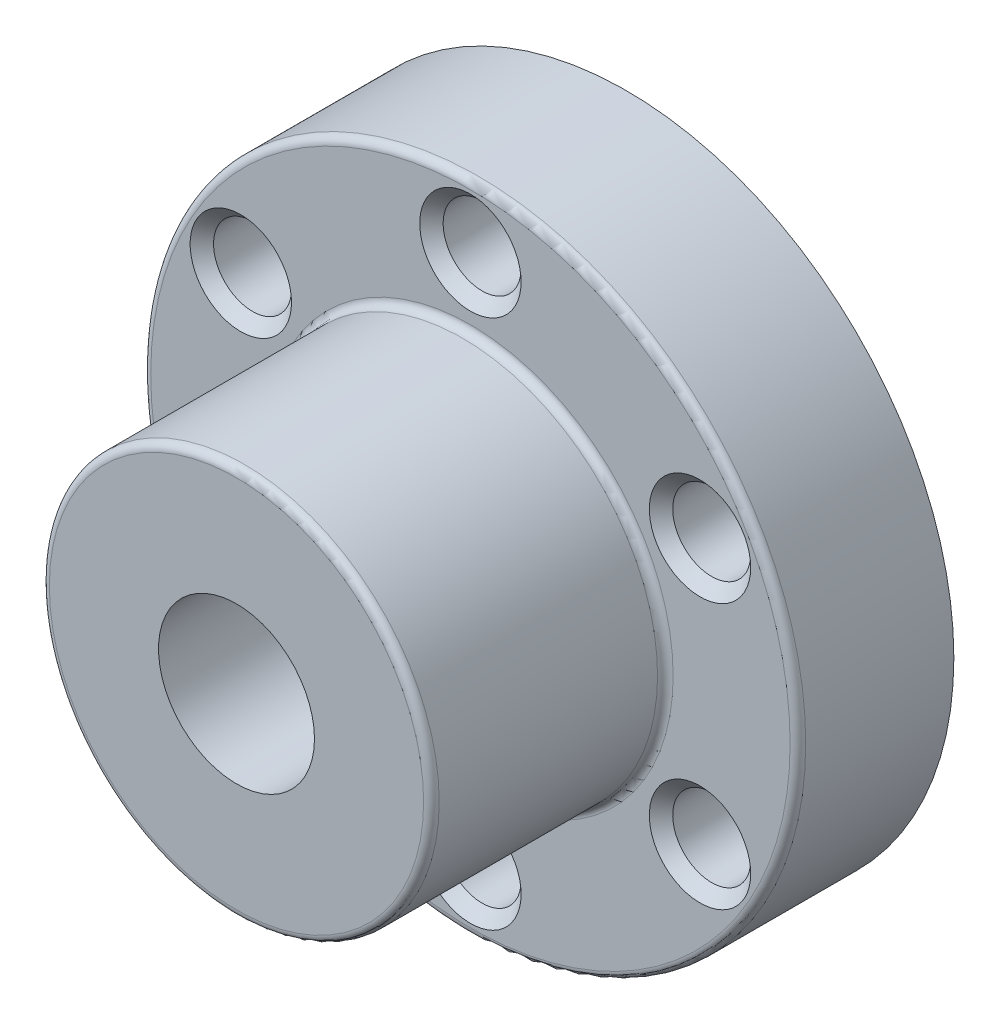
ISO-10303-21;
HEADER;
FILE_DESCRIPTION(('STEP AP214'),'2;1');
FILE_NAME('part.step','',(''),(''),'','','');
FILE_SCHEMA(('AUTOMOTIVE_DESIGN { 1 0 10303 214 1 1 1 1 }'));
ENDSEC;
DATA;
#1=APPLICATION_CONTEXT('core data for automotive mechanical design processes');
#2=APPLICATION_PROTOCOL_DEFINITION('international standard','automotive_design',2000,#1);
#3=PRODUCT_CONTEXT('',#1,'mechanical');
#4=PRODUCT('Part','Part','',(#3));
#5=PRODUCT_RELATED_PRODUCT_CATEGORY('part','',(#4));
#6=PRODUCT_DEFINITION_FORMATION('','',#4);
#7=PRODUCT_DEFINITION_CONTEXT('part definition',#1,'design');
#8=PRODUCT_DEFINITION('design','',#6,#7);
#9=PRODUCT_DEFINITION_SHAPE('','',#8);
#10=(LENGTH_UNIT() NAMED_UNIT(*) SI_UNIT(.MILLI.,.METRE.));
#11=(NAMED_UNIT(*) PLANE_ANGLE_UNIT() SI_UNIT($,.RADIAN.));
#12=(NAMED_UNIT(*) SI_UNIT($,.STERADIAN.) SOLID_ANGLE_UNIT());
#13=UNCERTAINTY_MEASURE_WITH_UNIT(LENGTH_MEASURE(1.E-05),#10,'distance_accuracy_value','');
#14=(GEOMETRIC_REPRESENTATION_CONTEXT(3) GLOBAL_UNCERTAINTY_ASSIGNED_CONTEXT((#13)) GLOBAL_UNIT_ASSIGNED_CONTEXT((#10,
#11,#12)) REPRESENTATION_CONTEXT('',''));
#15=CARTESIAN_POINT('',(0.,0.,0.));
#16=DIRECTION('',(0.,0.,1.));
#17=DIRECTION('',(1.,0.,0.));
#18=AXIS2_PLACEMENT_3D('',#15,#16,#17);
#19=CARTESIAN_POINT('',(0.,0.,10.));
#20=DIRECTION('',(0.,0.,1.));
#21=DIRECTION('',(1.,0.,0.));
#22=AXIS2_PLACEMENT_3D('',#19,#20,#21);
#23=PLANE('',#22);
#24=CARTESIAN_POINT('',(-14.7224318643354,8.50000000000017,10.));
#25=DIRECTION('',(0.,0.,1.));
#26=DIRECTION('',(1.,0.,0.));
#27=AXIS2_PLACEMENT_3D('',#24,#25,#26);
#28=CIRCLE('',#27,3.25);
#29=CARTESIAN_POINT('',(-11.4724318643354,8.50000000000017,10.));
#30=VERTEX_POINT('',#29);
#31=EDGE_CURVE('E10',#30,#30,#28,.F.);
#32=ORIENTED_EDGE('',*,*,#31,.T.);
#33=EDGE_LOOP('',(#32));
#34=FACE_BOUND('',#33,.T.);
#35=CARTESIAN_POINT('',(-14.7224318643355,-8.49999999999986,10.));
#36=DIRECTION('',(0.,0.,1.));
#37=DIRECTION('',(1.,0.,0.));
#38=AXIS2_PLACEMENT_3D('',#35,#36,#37);
#39=CIRCLE('',#38,3.25);
#40=CARTESIAN_POINT('',(-11.4724318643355,-8.49999999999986,10.));
#41=VERTEX_POINT('',#40);
#42=EDGE_CURVE('E42',#41,#41,#39,.F.);
#43=ORIENTED_EDGE('',*,*,#42,.T.);
#44=EDGE_LOOP('',(#43));
#45=FACE_BOUND('',#44,.T.);
#46=CARTESIAN_POINT('',(0.,-17.,10.));
#47=DIRECTION('',(0.,0.,1.));
#48=DIRECTION('',(1.,0.,0.));
#49=AXIS2_PLACEMENT_3D('',#46,#47,#48);
#50=CIRCLE('',#49,3.25);
#51=CARTESIAN_POINT('',(3.25,-17.,10.));
#52=VERTEX_POINT('',#51);
#53=EDGE_CURVE('E51',#52,#52,#50,.F.);
#54=ORIENTED_EDGE('',*,*,#53,.T.);
#55=EDGE_LOOP('',(#54));
#56=FACE_BOUND('',#55,.T.);
#57=CARTESIAN_POINT('',(14.7224318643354,-8.50000000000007,10.));
#58=DIRECTION('',(0.,0.,1.));
#59=DIRECTION('',(1.,0.,0.));
#60=AXIS2_PLACEMENT_3D('',#57,#58,#59);
#61=CIRCLE('',#60,3.25);
#62=CARTESIAN_POINT('',(17.9724318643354,-8.50000000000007,10.));
#63=VERTEX_POINT('',#62);
#64=EDGE_CURVE('E57',#63,#63,#61,.F.);
#65=ORIENTED_EDGE('',*,*,#64,.T.);
#66=EDGE_LOOP('',(#65));
#67=FACE_BOUND('',#66,.T.);
#68=CARTESIAN_POINT('',(14.7224318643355,8.49999999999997,10.));
#69=DIRECTION('',(0.,0.,1.));
#70=DIRECTION('',(1.,0.,0.));
#71=AXIS2_PLACEMENT_3D('',#68,#69,#70);
#72=CIRCLE('',#71,3.25);
#73=CARTESIAN_POINT('',(17.9724318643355,8.49999999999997,10.));
#74=VERTEX_POINT('',#73);
#75=EDGE_CURVE('E63',#74,#74,#72,.F.);
#76=ORIENTED_EDGE('',*,*,#75,.T.);
#77=EDGE_LOOP('',(#76));
#78=FACE_BOUND('',#77,.T.);
#79=CARTESIAN_POINT('',(0.,17.,10.));
#80=DIRECTION('',(0.,0.,1.));
#81=DIRECTION('',(1.,0.,0.));
#82=AXIS2_PLACEMENT_3D('',#79,#80,#81);
#83=CIRCLE('',#82,3.25);
#84=CARTESIAN_POINT('',(3.25,17.,10.));
#85=VERTEX_POINT('',#84);
#86=EDGE_CURVE('E69',#85,#85,#83,.F.);
#87=ORIENTED_EDGE('',*,*,#86,.T.);
#88=EDGE_LOOP('',(#87));
#89=FACE_BOUND('',#88,.T.);
#90=CARTESIAN_POINT('',(0.,0.,10.));
#91=DIRECTION('',(0.,0.,1.));
#92=DIRECTION('',(1.,0.,0.));
#93=AXIS2_PLACEMENT_3D('',#90,#91,#92);
#94=CIRCLE('',#93,20.5);
#95=CARTESIAN_POINT('',(20.5,0.,10.));
#96=VERTEX_POINT('',#95);
#97=EDGE_CURVE('E87',#96,#96,#94,.T.);
#98=ORIENTED_EDGE('',*,*,#97,.T.);
#99=EDGE_LOOP('',(#98));
#100=FACE_BOUND('',#99,.T.);
#101=CARTESIAN_POINT('',(0.,0.,10.));
#102=DIRECTION('',(0.,0.,1.));
#103=DIRECTION('',(1.,0.,0.));
#104=AXIS2_PLACEMENT_3D('',#101,#102,#103);
#105=CIRCLE('',#104,13.);
#106=CARTESIAN_POINT('',(13.,0.,10.));
#107=VERTEX_POINT('',#106);
#108=EDGE_CURVE('E90',#107,#107,#105,.F.);
#109=ORIENTED_EDGE('',*,*,#108,.T.);
#110=EDGE_LOOP('',(#109));
#111=FACE_BOUND('',#110,.T.);
#112=ADVANCED_FACE('F31',(#34,#45,#56,#67,#78,#89,#100,#111),#23,.T.);
#113=CARTESIAN_POINT('',(0.,0.,10.));
#114=DIRECTION('',(0.,0.,-1.));
#115=DIRECTION('',(-1.,0.,0.));
#116=AXIS2_PLACEMENT_3D('',#113,#114,#115);
#117=CYLINDRICAL_SURFACE('',#116,21.);
#118=CARTESIAN_POINT('',(0.,0.,9.5));
#119=DIRECTION('',(0.,0.,1.));
#120=DIRECTION('',(1.,0.,0.));
#121=AXIS2_PLACEMENT_3D('',#118,#119,#120);
#122=CIRCLE('',#121,21.);
#123=CARTESIAN_POINT('',(21.,0.,9.5));
#124=VERTEX_POINT('',#123);
#125=EDGE_CURVE('E84',#124,#124,#122,.F.);
#126=ORIENTED_EDGE('',*,*,#125,.T.);
#127=EDGE_LOOP('',(#126));
#128=FACE_BOUND('',#127,.T.);
#129=CARTESIAN_POINT('',(0.,0.,0.));
#130=DIRECTION('',(0.,0.,1.));
#131=DIRECTION('',(1.,0.,0.));
#132=AXIS2_PLACEMENT_3D('',#129,#130,#131);
#133=CIRCLE('',#132,21.);
#134=CARTESIAN_POINT('',(21.,0.,0.));
#135=VERTEX_POINT('',#134);
#136=EDGE_CURVE('E93',#135,#135,#133,.T.);
#137=ORIENTED_EDGE('',*,*,#136,.T.);
#138=EDGE_LOOP('',(#137));
#139=FACE_BOUND('',#138,.T.);
#140=ADVANCED_FACE('F127',(#128,#139),#117,.T.);
#141=CARTESIAN_POINT('',(0.,0.,0.));
#142=DIRECTION('',(0.,0.,1.));
#143=DIRECTION('',(1.,0.,0.));
#144=AXIS2_PLACEMENT_3D('',#141,#142,#143);
#145=PLANE('',#144);
#146=CARTESIAN_POINT('',(-14.7224318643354,8.50000000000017,0.));
#147=DIRECTION('',(0.,0.,-1.));
#148=DIRECTION('',(-0.50000000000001,-0.866025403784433,0.));
#149=AXIS2_PLACEMENT_3D('',#146,#147,#148);
#150=CIRCLE('',#149,2.5);
#151=CARTESIAN_POINT('',(-15.9724318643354,6.33493649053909,0.));
#152=VERTEX_POINT('',#151);
#153=EDGE_CURVE('E117',#152,#152,#150,.T.);
#154=ORIENTED_EDGE('',*,*,#153,.F.);
#155=EDGE_LOOP('',(#154));
#156=FACE_BOUND('',#155,.T.);
#157=CARTESIAN_POINT('',(-14.7224318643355,-8.49999999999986,0.));
#158=DIRECTION('',(0.,0.,-1.));
#159=DIRECTION('',(0.499999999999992,-0.866025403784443,0.));
#160=AXIS2_PLACEMENT_3D('',#157,#158,#159);
#161=CIRCLE('',#160,2.5);
#162=CARTESIAN_POINT('',(-13.4724318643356,-10.665063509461,0.));
#163=VERTEX_POINT('',#162);
#164=EDGE_CURVE('E114',#163,#163,#161,.T.);
#165=ORIENTED_EDGE('',*,*,#164,.F.);
#166=EDGE_LOOP('',(#165));
#167=FACE_BOUND('',#166,.T.);
#168=CARTESIAN_POINT('',(0.,-17.,0.));
#169=DIRECTION('',(0.,0.,-1.));
#170=DIRECTION('',(1.,0.,0.));
#171=AXIS2_PLACEMENT_3D('',#168,#169,#170);
#172=CIRCLE('',#171,2.5);
#173=CARTESIAN_POINT('',(2.5,-17.,0.));
#174=VERTEX_POINT('',#173);
#175=EDGE_CURVE('E111',#174,#174,#172,.T.);
#176=ORIENTED_EDGE('',*,*,#175,.F.);
#177=EDGE_LOOP('',(#176));
#178=FACE_BOUND('',#177,.T.);
#179=CARTESIAN_POINT('',(14.7224318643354,-8.50000000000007,0.));
#180=DIRECTION('',(0.,0.,-1.));
#181=DIRECTION('',(0.500000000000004,0.866025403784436,0.));
#182=AXIS2_PLACEMENT_3D('',#179,#180,#181);
#183=CIRCLE('',#182,2.5);
#184=CARTESIAN_POINT('',(15.9724318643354,-6.33493649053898,0.));
#185=VERTEX_POINT('',#184);
#186=EDGE_CURVE('E108',#185,#185,#183,.T.);
#187=ORIENTED_EDGE('',*,*,#186,.F.);
#188=EDGE_LOOP('',(#187));
#189=FACE_BOUND('',#188,.T.);
#190=CARTESIAN_POINT('',(14.7224318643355,8.49999999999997,0.));
#191=DIRECTION('',(0.,0.,-1.));
#192=DIRECTION('',(-0.499999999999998,0.86602540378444,0.));
#193=AXIS2_PLACEMENT_3D('',#190,#191,#192);
#194=CIRCLE('',#193,2.5);
#195=CARTESIAN_POINT('',(13.4724318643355,10.6650635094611,0.));
#196=VERTEX_POINT('',#195);
#197=EDGE_CURVE('E105',#196,#196,#194,.T.);
#198=ORIENTED_EDGE('',*,*,#197,.F.);
#199=EDGE_LOOP('',(#198));
#200=FACE_BOUND('',#199,.T.);
#201=CARTESIAN_POINT('',(0.,17.,0.));
#202=DIRECTION('',(0.,0.,-1.));
#203=DIRECTION('',(-1.,0.,0.));
#204=AXIS2_PLACEMENT_3D('',#201,#202,#203);
#205=CIRCLE('',#204,2.5);
#206=CARTESIAN_POINT('',(-2.5,17.,0.));
#207=VERTEX_POINT('',#206);
#208=EDGE_CURVE('E100',#207,#207,#205,.T.);
#209=ORIENTED_EDGE('',*,*,#208,.F.);
#210=EDGE_LOOP('',(#209));
#211=FACE_BOUND('',#210,.T.);
#212=CARTESIAN_POINT('',(0.,0.,0.));
#213=DIRECTION('',(0.,0.,1.));
#214=DIRECTION('',(1.,0.,0.));
#215=AXIS2_PLACEMENT_3D('',#212,#213,#214);
#216=CIRCLE('',#215,5.);
#217=CARTESIAN_POINT('',(5.,0.,0.));
#218=VERTEX_POINT('',#217);
#219=EDGE_CURVE('E96',#218,#218,#216,.T.);
#220=ORIENTED_EDGE('',*,*,#219,.T.);
#221=EDGE_LOOP('',(#220));
#222=FACE_BOUND('',#221,.T.);
#223=ORIENTED_EDGE('',*,*,#136,.F.);
#224=EDGE_LOOP('',(#223));
#225=FACE_BOUND('',#224,.T.);
#226=ADVANCED_FACE('F123',(#156,#167,#178,#189,#200,#211,#222,#225),#145,.F.);
#227=CARTESIAN_POINT('',(0.,0.,25.));
#228=DIRECTION('',(0.,0.,-1.));
#229=DIRECTION('',(-1.,0.,0.));
#230=AXIS2_PLACEMENT_3D('',#227,#228,#229);
#231=CYLINDRICAL_SURFACE('',#230,12.5);
#232=CARTESIAN_POINT('',(0.,0.,10.5));
#233=DIRECTION('',(0.,0.,1.));
#234=DIRECTION('',(1.,0.,0.));
#235=AXIS2_PLACEMENT_3D('',#232,#233,#234);
#236=CIRCLE('',#235,12.5);
#237=CARTESIAN_POINT('',(12.5,0.,10.5));
#238=VERTEX_POINT('',#237);
#239=EDGE_CURVE('E78',#238,#238,#236,.T.);
#240=ORIENTED_EDGE('',*,*,#239,.T.);
#241=EDGE_LOOP('',(#240));
#242=FACE_BOUND('',#241,.T.);
#243=CARTESIAN_POINT('',(0.,0.,24.5));
#244=DIRECTION('',(0.,0.,1.));
#245=DIRECTION('',(1.,0.,0.));
#246=AXIS2_PLACEMENT_3D('',#243,#244,#245);
#247=CIRCLE('',#246,12.5);
#248=CARTESIAN_POINT('',(12.5,0.,24.5));
#249=VERTEX_POINT('',#248);
#250=EDGE_CURVE('E81',#249,#249,#247,.F.);
#251=ORIENTED_EDGE('',*,*,#250,.T.);
#252=EDGE_LOOP('',(#251));
#253=FACE_BOUND('',#252,.T.);
#254=ADVANCED_FACE('F126',(#242,#253),#231,.T.);
#255=CARTESIAN_POINT('',(0.,0.,25.));
#256=DIRECTION('',(0.,0.,1.));
#257=DIRECTION('',(1.,0.,0.));
#258=AXIS2_PLACEMENT_3D('',#255,#256,#257);
#259=PLANE('',#258);
#260=CARTESIAN_POINT('',(0.,0.,25.));
#261=DIRECTION('',(0.,0.,1.));
#262=DIRECTION('',(1.,0.,0.));
#263=AXIS2_PLACEMENT_3D('',#260,#261,#262);
#264=CIRCLE('',#263,12.);
#265=CARTESIAN_POINT('',(12.,0.,25.));
#266=VERTEX_POINT('',#265);
#267=EDGE_CURVE('E75',#266,#266,#264,.T.);
#268=ORIENTED_EDGE('',*,*,#267,.T.);
#269=EDGE_LOOP('',(#268));
#270=FACE_BOUND('',#269,.T.);
#271=CARTESIAN_POINT('',(0.,0.,25.));
#272=DIRECTION('',(0.,0.,1.));
#273=DIRECTION('',(1.,0.,0.));
#274=AXIS2_PLACEMENT_3D('',#271,#272,#273);
#275=CIRCLE('',#274,5.);
#276=CARTESIAN_POINT('',(5.,0.,25.));
#277=VERTEX_POINT('',#276);
#278=EDGE_CURVE('E97',#277,#277,#275,.T.);
#279=ORIENTED_EDGE('',*,*,#278,.F.);
#280=EDGE_LOOP('',(#279));
#281=FACE_BOUND('',#280,.T.);
#282=ADVANCED_FACE('F217',(#270,#281),#259,.T.);
#283=CARTESIAN_POINT('',(0.,0.,0.));
#284=DIRECTION('',(0.,0.,1.));
#285=DIRECTION('',(1.,0.,0.));
#286=AXIS2_PLACEMENT_3D('',#283,#284,#285);
#287=CYLINDRICAL_SURFACE('',#286,5.);
#288=ORIENTED_EDGE('',*,*,#219,.F.);
#289=EDGE_LOOP('',(#288));
#290=FACE_BOUND('',#289,.T.);
#291=ORIENTED_EDGE('',*,*,#278,.T.);
#292=EDGE_LOOP('',(#291));
#293=FACE_BOUND('',#292,.T.);
#294=ADVANCED_FACE('F213',(#290,#293),#287,.F.);
#295=CARTESIAN_POINT('',(0.,17.,25.));
#296=DIRECTION('',(0.,0.,-1.));
#297=DIRECTION('',(-1.,0.,0.));
#298=AXIS2_PLACEMENT_3D('',#295,#296,#297);
#299=CYLINDRICAL_SURFACE('',#298,2.5);
#300=CARTESIAN_POINT('',(0.,17.,9.24999999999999));
#301=DIRECTION('',(0.,0.,1.));
#302=DIRECTION('',(1.,0.,0.));
#303=AXIS2_PLACEMENT_3D('',#300,#301,#302);
#304=CIRCLE('',#303,2.5);
#305=CARTESIAN_POINT('',(2.5,17.,9.24999999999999));
#306=VERTEX_POINT('',#305);
#307=EDGE_CURVE('E72',#306,#306,#304,.T.);
#308=ORIENTED_EDGE('',*,*,#307,.T.);
#309=EDGE_LOOP('',(#308));
#310=FACE_BOUND('',#309,.T.);
#311=ORIENTED_EDGE('',*,*,#208,.T.);
#312=EDGE_LOOP('',(#311));
#313=FACE_BOUND('',#312,.T.);
#314=ADVANCED_FACE('F155',(#310,#313),#299,.F.);
#315=CARTESIAN_POINT('',(0.,0.,9.5));
#316=DIRECTION('',(0.,0.,1.));
#317=DIRECTION('',(1.,0.,0.));
#318=AXIS2_PLACEMENT_3D('',#315,#316,#317);
#319=TOROIDAL_SURFACE('',#318,20.5,0.5);
#320=ORIENTED_EDGE('',*,*,#125,.F.);
#321=EDGE_LOOP('',(#320));
#322=FACE_BOUND('',#321,.T.);
#323=ORIENTED_EDGE('',*,*,#97,.F.);
#324=EDGE_LOOP('',(#323));
#325=FACE_BOUND('',#324,.T.);
#326=ADVANCED_FACE('F151',(#322,#325),#319,.T.);
#327=CARTESIAN_POINT('',(0.,0.,10.5));
#328=DIRECTION('',(0.,0.,1.));
#329=DIRECTION('',(1.,0.,0.));
#330=AXIS2_PLACEMENT_3D('',#327,#328,#329);
#331=TOROIDAL_SURFACE('',#330,13.,0.5);
#332=ORIENTED_EDGE('',*,*,#108,.F.);
#333=EDGE_LOOP('',(#332));
#334=FACE_BOUND('',#333,.T.);
#335=ORIENTED_EDGE('',*,*,#239,.F.);
#336=EDGE_LOOP('',(#335));
#337=FACE_BOUND('',#336,.T.);
#338=ADVANCED_FACE('F154',(#334,#337),#331,.F.);
#339=CARTESIAN_POINT('',(0.,0.,24.5));
#340=DIRECTION('',(0.,0.,1.));
#341=DIRECTION('',(1.,0.,0.));
#342=AXIS2_PLACEMENT_3D('',#339,#340,#341);
#343=TOROIDAL_SURFACE('',#342,12.,0.5);
#344=ORIENTED_EDGE('',*,*,#250,.F.);
#345=EDGE_LOOP('',(#344));
#346=FACE_BOUND('',#345,.T.);
#347=ORIENTED_EDGE('',*,*,#267,.F.);
#348=EDGE_LOOP('',(#347));
#349=FACE_BOUND('',#348,.T.);
#350=ADVANCED_FACE('F159',(#346,#349),#343,.T.);
#351=CARTESIAN_POINT('',(0.,17.,9.24999999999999));
#352=DIRECTION('',(0.,0.,1.));
#353=DIRECTION('',(1.,0.,0.));
#354=AXIS2_PLACEMENT_3D('',#351,#352,#353);
#355=CONICAL_SURFACE('',#354,2.5,0.785398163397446);
#356=CARTESIAN_POINT('',(3.25,17.,10.));
#357=CARTESIAN_POINT('',(3.2421875,17.,9.9921875));
#358=CARTESIAN_POINT('',(3.234375,17.,9.984375));
#359=CARTESIAN_POINT('',(3.21875,17.,9.96875));
#360=CARTESIAN_POINT('',(3.2109375,17.,9.9609375));
#361=CARTESIAN_POINT('',(3.1953125,17.,9.9453125));
#362=CARTESIAN_POINT('',(3.1875,17.,9.9375));
#363=CARTESIAN_POINT('',(3.171875,17.,9.921875));
#364=CARTESIAN_POINT('',(3.1640625,17.,9.9140625));
#365=CARTESIAN_POINT('',(3.1484375,17.,9.8984375));
#366=CARTESIAN_POINT('',(3.140625,17.,9.890625));
#367=CARTESIAN_POINT('',(3.125,17.,9.875));
#368=CARTESIAN_POINT('',(3.1171875,17.,9.8671875));
#369=CARTESIAN_POINT('',(3.1015625,17.,9.8515625));
#370=CARTESIAN_POINT('',(3.09375,17.,9.84375));
#371=CARTESIAN_POINT('',(3.078125,17.,9.828125));
#372=CARTESIAN_POINT('',(3.0703125,17.,9.8203125));
#373=CARTESIAN_POINT('',(3.0546875,17.,9.8046875));
#374=CARTESIAN_POINT('',(3.046875,17.,9.796875));
#375=CARTESIAN_POINT('',(3.03125,17.,9.78125));
#376=CARTESIAN_POINT('',(3.0234375,17.,9.7734375));
#377=CARTESIAN_POINT('',(3.0078125,17.,9.7578125));
#378=CARTESIAN_POINT('',(3.,17.,9.75));
#379=CARTESIAN_POINT('',(2.984375,17.,9.734375));
#380=CARTESIAN_POINT('',(2.9765625,17.,9.7265625));
#381=CARTESIAN_POINT('',(2.9609375,17.,9.7109375));
#382=CARTESIAN_POINT('',(2.953125,17.,9.703125));
#383=CARTESIAN_POINT('',(2.9375,17.,9.6875));
#384=CARTESIAN_POINT('',(2.9296875,17.,9.6796875));
#385=CARTESIAN_POINT('',(2.9140625,17.,9.6640625));
#386=CARTESIAN_POINT('',(2.90625,17.,9.65625));
#387=CARTESIAN_POINT('',(2.890625,17.,9.640625));
#388=CARTESIAN_POINT('',(2.8828125,17.,9.6328125));
#389=CARTESIAN_POINT('',(2.8671875,17.,9.61718749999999));
#390=CARTESIAN_POINT('',(2.859375,17.,9.609375));
#391=CARTESIAN_POINT('',(2.84375,17.,9.59375));
#392=CARTESIAN_POINT('',(2.8359375,17.,9.58593749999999));
#393=CARTESIAN_POINT('',(2.8203125,17.,9.57031249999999));
#394=CARTESIAN_POINT('',(2.8125,17.,9.5625));
#395=CARTESIAN_POINT('',(2.796875,17.,9.546875));
#396=CARTESIAN_POINT('',(2.7890625,17.,9.53906249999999));
#397=CARTESIAN_POINT('',(2.7734375,17.,9.52343749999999));
#398=CARTESIAN_POINT('',(2.765625,17.,9.515625));
#399=CARTESIAN_POINT('',(2.75,17.,9.49999999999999));
#400=CARTESIAN_POINT('',(2.7421875,17.,9.49218749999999));
#401=CARTESIAN_POINT('',(2.7265625,17.,9.47656249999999));
#402=CARTESIAN_POINT('',(2.71875,17.,9.46874999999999));
#403=CARTESIAN_POINT('',(2.703125,17.,9.45312499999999));
#404=CARTESIAN_POINT('',(2.6953125,17.,9.44531249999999));
#405=CARTESIAN_POINT('',(2.6796875,17.,9.42968749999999));
#406=CARTESIAN_POINT('',(2.671875,17.,9.42187499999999));
#407=CARTESIAN_POINT('',(2.65625,17.,9.40624999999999));
#408=CARTESIAN_POINT('',(2.6484375,17.,9.39843749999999));
#409=CARTESIAN_POINT('',(2.6328125,17.,9.38281249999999));
#410=CARTESIAN_POINT('',(2.625,17.,9.37499999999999));
#411=CARTESIAN_POINT('',(2.609375,17.,9.35937499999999));
#412=CARTESIAN_POINT('',(2.6015625,17.,9.35156249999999));
#413=CARTESIAN_POINT('',(2.5859375,17.,9.33593749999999));
#414=CARTESIAN_POINT('',(2.578125,17.,9.32812499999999));
#415=CARTESIAN_POINT('',(2.5625,17.,9.31249999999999));
#416=CARTESIAN_POINT('',(2.5546875,17.,9.30468749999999));
#417=CARTESIAN_POINT('',(2.5390625,17.,9.28906249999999));
#418=CARTESIAN_POINT('',(2.53125,17.,9.28124999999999));
#419=CARTESIAN_POINT('',(2.515625,17.,9.26562499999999));
#420=CARTESIAN_POINT('',(2.5078125,17.,9.25781249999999));
#421=CARTESIAN_POINT('',(2.5,17.,9.24999999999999));
#422=B_SPLINE_CURVE_WITH_KNOTS('',3,(#356,#357,#358,#359,#360,#361,#362,#363,#364,#365,#366,
#367,#368,#369,#370,#371,#372,#373,#374,#375,#376,#377,#378,#379,#380,#381,#382,#383,#384,#385,
#386,#387,#388,#389,#390,#391,#392,#393,#394,#395,#396,#397,#398,#399,#400,#401,#402,#403,#404,
#405,#406,#407,#408,#409,#410,#411,#412,#413,#414,#415,#416,#417,#418,#419,#420,#421),
.UNSPECIFIED.,.F.,.F.,(4,2,2,2,2,2,2,2,2,2,2,2,2,2,2,2,2,2,2,2,2,2,2,2,2,2,2,2,2,2,2,2,4),(0.,
0.0331456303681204,0.0662912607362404,0.0994368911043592,0.132582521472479,0.165728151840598,
0.198873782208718,0.232019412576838,0.265165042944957,0.298310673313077,0.331456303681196,
0.364601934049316,0.397747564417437,0.430893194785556,0.464038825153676,0.497184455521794,
0.530330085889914,0.563475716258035,0.596621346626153,0.629766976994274,0.662912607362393,
0.696058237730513,0.729203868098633,0.762349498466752,0.795495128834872,0.828640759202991,
0.861786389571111,0.894932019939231,0.92807765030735,0.96122328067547,0.994368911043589,
1.02751454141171,1.06066017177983),.UNSPECIFIED.);
#423=EDGE_CURVE('BSEAM163',#85,#306,#422,.T.);
#424=ORIENTED_EDGE('',*,*,#86,.F.);
#425=ORIENTED_EDGE('',*,*,#307,.F.);
#426=ORIENTED_EDGE('',*,*,#423,.T.);
#427=ORIENTED_EDGE('',*,*,#423,.F.);
#428=EDGE_LOOP('',(#424,#426,#425,#427));
#429=FACE_BOUND('',#428,.T.);
#430=ADVANCED_FACE('F163',(#429),#355,.F.);
#431=CARTESIAN_POINT('',(14.7224318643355,8.49999999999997,25.));
#432=DIRECTION('',(0.,0.,-1.));
#433=DIRECTION('',(-1.,0.,0.));
#434=AXIS2_PLACEMENT_3D('',#431,#432,#433);
#435=CYLINDRICAL_SURFACE('',#434,2.5);
#436=CARTESIAN_POINT('',(14.7224318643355,8.49999999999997,9.24999999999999));
#437=DIRECTION('',(0.,0.,1.));
#438=DIRECTION('',(1.,0.,0.));
#439=AXIS2_PLACEMENT_3D('',#436,#437,#438);
#440=CIRCLE('',#439,2.5);
#441=CARTESIAN_POINT('',(17.2224318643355,8.49999999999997,9.24999999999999));
#442=VERTEX_POINT('',#441);
#443=EDGE_CURVE('E66',#442,#442,#440,.T.);
#444=ORIENTED_EDGE('',*,*,#443,.T.);
#445=EDGE_LOOP('',(#444));
#446=FACE_BOUND('',#445,.T.);
#447=ORIENTED_EDGE('',*,*,#197,.T.);
#448=EDGE_LOOP('',(#447));
#449=FACE_BOUND('',#448,.T.);
#450=ADVANCED_FACE('F167',(#446,#449),#435,.F.);
#451=CARTESIAN_POINT('',(14.7224318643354,-8.50000000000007,25.));
#452=DIRECTION('',(0.,0.,-1.));
#453=DIRECTION('',(-1.,0.,0.));
#454=AXIS2_PLACEMENT_3D('',#451,#452,#453);
#455=CYLINDRICAL_SURFACE('',#454,2.5);
#456=CARTESIAN_POINT('',(14.7224318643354,-8.50000000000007,9.24999999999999));
#457=DIRECTION('',(0.,0.,1.));
#458=DIRECTION('',(1.,0.,0.));
#459=AXIS2_PLACEMENT_3D('',#456,#457,#458);
#460=CIRCLE('',#459,2.5);
#461=CARTESIAN_POINT('',(17.2224318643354,-8.50000000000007,9.24999999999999));
#462=VERTEX_POINT('',#461);
#463=EDGE_CURVE('E60',#462,#462,#460,.T.);
#464=ORIENTED_EDGE('',*,*,#463,.T.);
#465=EDGE_LOOP('',(#464));
#466=FACE_BOUND('',#465,.T.);
#467=ORIENTED_EDGE('',*,*,#186,.T.);
#468=EDGE_LOOP('',(#467));
#469=FACE_BOUND('',#468,.T.);
#470=ADVANCED_FACE('F201',(#466,#469),#455,.F.);
#471=CARTESIAN_POINT('',(0.,-17.,25.));
#472=DIRECTION('',(0.,0.,-1.));
#473=DIRECTION('',(-1.,0.,0.));
#474=AXIS2_PLACEMENT_3D('',#471,#472,#473);
#475=CYLINDRICAL_SURFACE('',#474,2.5);
#476=CARTESIAN_POINT('',(0.,-17.,9.24999999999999));
#477=DIRECTION('',(0.,0.,1.));
#478=DIRECTION('',(1.,0.,0.));
#479=AXIS2_PLACEMENT_3D('',#476,#477,#478);
#480=CIRCLE('',#479,2.5);
#481=CARTESIAN_POINT('',(2.5,-17.,9.24999999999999));
#482=VERTEX_POINT('',#481);
#483=EDGE_CURVE('E54',#482,#482,#480,.T.);
#484=ORIENTED_EDGE('',*,*,#483,.T.);
#485=EDGE_LOOP('',(#484));
#486=FACE_BOUND('',#485,.T.);
#487=ORIENTED_EDGE('',*,*,#175,.T.);
#488=EDGE_LOOP('',(#487));
#489=FACE_BOUND('',#488,.T.);
#490=ADVANCED_FACE('F194',(#486,#489),#475,.F.);
#491=CARTESIAN_POINT('',(-14.7224318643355,-8.49999999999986,25.));
#492=DIRECTION('',(0.,0.,-1.));
#493=DIRECTION('',(-1.,0.,0.));
#494=AXIS2_PLACEMENT_3D('',#491,#492,#493);
#495=CYLINDRICAL_SURFACE('',#494,2.5);
#496=CARTESIAN_POINT('',(-14.7224318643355,-8.49999999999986,9.24999999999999));
#497=DIRECTION('',(0.,0.,1.));
#498=DIRECTION('',(1.,0.,0.));
#499=AXIS2_PLACEMENT_3D('',#496,#497,#498);
#500=CIRCLE('',#499,2.5);
#501=CARTESIAN_POINT('',(-12.2224318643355,-8.49999999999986,9.24999999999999));
#502=VERTEX_POINT('',#501);
#503=EDGE_CURVE('E46',#502,#502,#500,.T.);
#504=ORIENTED_EDGE('',*,*,#503,.T.);
#505=EDGE_LOOP('',(#504));
#506=FACE_BOUND('',#505,.T.);
#507=ORIENTED_EDGE('',*,*,#164,.T.);
#508=EDGE_LOOP('',(#507));
#509=FACE_BOUND('',#508,.T.);
#510=ADVANCED_FACE('F191',(#506,#509),#495,.F.);
#511=CARTESIAN_POINT('',(-14.7224318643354,8.50000000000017,25.));
#512=DIRECTION('',(0.,0.,-1.));
#513=DIRECTION('',(-1.,0.,0.));
#514=AXIS2_PLACEMENT_3D('',#511,#512,#513);
#515=CYLINDRICAL_SURFACE('',#514,2.5);
#516=CARTESIAN_POINT('',(-14.7224318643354,8.50000000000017,9.24999999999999));
#517=DIRECTION('',(0.,0.,1.));
#518=DIRECTION('',(1.,0.,0.));
#519=AXIS2_PLACEMENT_3D('',#516,#517,#518);
#520=CIRCLE('',#519,2.5);
#521=CARTESIAN_POINT('',(-12.2224318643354,8.50000000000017,9.24999999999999));
#522=VERTEX_POINT('',#521);
#523=EDGE_CURVE('E38',#522,#522,#520,.T.);
#524=ORIENTED_EDGE('',*,*,#523,.T.);
#525=EDGE_LOOP('',(#524));
#526=FACE_BOUND('',#525,.T.);
#527=ORIENTED_EDGE('',*,*,#153,.T.);
#528=EDGE_LOOP('',(#527));
#529=FACE_BOUND('',#528,.T.);
#530=ADVANCED_FACE('F121',(#526,#529),#515,.F.);
#531=CARTESIAN_POINT('',(14.7224318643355,8.49999999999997,9.24999999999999));
#532=DIRECTION('',(0.,0.,1.));
#533=DIRECTION('',(1.,0.,0.));
#534=AXIS2_PLACEMENT_3D('',#531,#532,#533);
#535=CONICAL_SURFACE('',#534,2.5,0.785398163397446);
#536=CARTESIAN_POINT('',(17.9724318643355,8.49999999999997,10.));
#537=CARTESIAN_POINT('',(17.9646193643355,8.49999999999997,9.9921875));
#538=CARTESIAN_POINT('',(17.9568068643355,8.49999999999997,9.984375));
#539=CARTESIAN_POINT('',(17.9411818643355,8.49999999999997,9.96875));
#540=CARTESIAN_POINT('',(17.9333693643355,8.49999999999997,9.9609375));
#541=CARTESIAN_POINT('',(17.9177443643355,8.49999999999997,9.9453125));
#542=CARTESIAN_POINT('',(17.9099318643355,8.49999999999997,9.9375));
#543=CARTESIAN_POINT('',(17.8943068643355,8.49999999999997,9.921875));
#544=CARTESIAN_POINT('',(17.8864943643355,8.49999999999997,9.9140625));
#545=CARTESIAN_POINT('',(17.8708693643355,8.49999999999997,9.8984375));
#546=CARTESIAN_POINT('',(17.8630568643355,8.49999999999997,9.890625));
#547=CARTESIAN_POINT('',(17.8474318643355,8.49999999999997,9.875));
#548=CARTESIAN_POINT('',(17.8396193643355,8.49999999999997,9.8671875));
#549=CARTESIAN_POINT('',(17.8239943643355,8.49999999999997,9.8515625));
#550=CARTESIAN_POINT('',(17.8161818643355,8.49999999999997,9.84375));
#551=CARTESIAN_POINT('',(17.8005568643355,8.49999999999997,9.828125));
#552=CARTESIAN_POINT('',(17.7927443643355,8.49999999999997,9.8203125));
#553=CARTESIAN_POINT('',(17.7771193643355,8.49999999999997,9.8046875));
#554=CARTESIAN_POINT('',(17.7693068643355,8.49999999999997,9.796875));
#555=CARTESIAN_POINT('',(17.7536818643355,8.49999999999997,9.78125));
#556=CARTESIAN_POINT('',(17.7458693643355,8.49999999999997,9.7734375));
#557=CARTESIAN_POINT('',(17.7302443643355,8.49999999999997,9.7578125));
#558=CARTESIAN_POINT('',(17.7224318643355,8.49999999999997,9.75));
#559=CARTESIAN_POINT('',(17.7068068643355,8.49999999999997,9.734375));
#560=CARTESIAN_POINT('',(17.6989943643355,8.49999999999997,9.7265625));
#561=CARTESIAN_POINT('',(17.6833693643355,8.49999999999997,9.7109375));
#562=CARTESIAN_POINT('',(17.6755568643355,8.49999999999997,9.703125));
#563=CARTESIAN_POINT('',(17.6599318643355,8.49999999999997,9.6875));
#564=CARTESIAN_POINT('',(17.6521193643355,8.49999999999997,9.6796875));
#565=CARTESIAN_POINT('',(17.6364943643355,8.49999999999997,9.6640625));
#566=CARTESIAN_POINT('',(17.6286818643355,8.49999999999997,9.65625));
#567=CARTESIAN_POINT('',(17.6130568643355,8.49999999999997,9.640625));
#568=CARTESIAN_POINT('',(17.6052443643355,8.49999999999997,9.6328125));
#569=CARTESIAN_POINT('',(17.5896193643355,8.49999999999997,9.61718749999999));
#570=CARTESIAN_POINT('',(17.5818068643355,8.49999999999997,9.609375));
#571=CARTESIAN_POINT('',(17.5661818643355,8.49999999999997,9.59375));
#572=CARTESIAN_POINT('',(17.5583693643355,8.49999999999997,9.58593749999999));
#573=CARTESIAN_POINT('',(17.5427443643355,8.49999999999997,9.57031249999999));
#574=CARTESIAN_POINT('',(17.5349318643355,8.49999999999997,9.5625));
#575=CARTESIAN_POINT('',(17.5193068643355,8.49999999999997,9.546875));
#576=CARTESIAN_POINT('',(17.5114943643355,8.49999999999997,9.53906249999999));
#577=CARTESIAN_POINT('',(17.4958693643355,8.49999999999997,9.52343749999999));
#578=CARTESIAN_POINT('',(17.4880568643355,8.49999999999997,9.515625));
#579=CARTESIAN_POINT('',(17.4724318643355,8.49999999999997,9.49999999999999));
#580=CARTESIAN_POINT('',(17.4646193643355,8.49999999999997,9.49218749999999));
#581=CARTESIAN_POINT('',(17.4489943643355,8.49999999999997,9.47656249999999));
#582=CARTESIAN_POINT('',(17.4411818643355,8.49999999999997,9.46874999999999));
#583=CARTESIAN_POINT('',(17.4255568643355,8.49999999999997,9.45312499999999));
#584=CARTESIAN_POINT('',(17.4177443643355,8.49999999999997,9.44531249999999));
#585=CARTESIAN_POINT('',(17.4021193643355,8.49999999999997,9.42968749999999));
#586=CARTESIAN_POINT('',(17.3943068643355,8.49999999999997,9.42187499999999));
#587=CARTESIAN_POINT('',(17.3786818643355,8.49999999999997,9.40624999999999));
#588=CARTESIAN_POINT('',(17.3708693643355,8.49999999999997,9.39843749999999));
#589=CARTESIAN_POINT('',(17.3552443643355,8.49999999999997,9.38281249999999));
#590=CARTESIAN_POINT('',(17.3474318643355,8.49999999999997,9.37499999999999));
#591=CARTESIAN_POINT('',(17.3318068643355,8.49999999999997,9.35937499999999));
#592=CARTESIAN_POINT('',(17.3239943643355,8.49999999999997,9.35156249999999));
#593=CARTESIAN_POINT('',(17.3083693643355,8.49999999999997,9.33593749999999));
#594=CARTESIAN_POINT('',(17.3005568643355,8.49999999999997,9.32812499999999));
#595=CARTESIAN_POINT('',(17.2849318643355,8.49999999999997,9.31249999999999));
#596=CARTESIAN_POINT('',(17.2771193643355,8.49999999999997,9.30468749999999));
#597=CARTESIAN_POINT('',(17.2614943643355,8.49999999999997,9.28906249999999));
#598=CARTESIAN_POINT('',(17.2536818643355,8.49999999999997,9.28124999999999));
#599=CARTESIAN_POINT('',(17.2380568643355,8.49999999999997,9.26562499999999));
#600=CARTESIAN_POINT('',(17.2302443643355,8.49999999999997,9.25781249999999));
#601=CARTESIAN_POINT('',(17.2224318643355,8.49999999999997,9.24999999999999));
#602=B_SPLINE_CURVE_WITH_KNOTS('',3,(#536,#537,#538,#539,#540,#541,#542,#543,#544,#545,#546,
#547,#548,#549,#550,#551,#552,#553,#554,#555,#556,#557,#558,#559,#560,#561,#562,#563,#564,#565,
#566,#567,#568,#569,#570,#571,#572,#573,#574,#575,#576,#577,#578,#579,#580,#581,#582,#583,#584,
#585,#586,#587,#588,#589,#590,#591,#592,#593,#594,#595,#596,#597,#598,#599,#600,#601),
.UNSPECIFIED.,.F.,.F.,(4,2,2,2,2,2,2,2,2,2,2,2,2,2,2,2,2,2,2,2,2,2,2,2,2,2,2,2,2,2,2,2,4),(0.,
0.0331456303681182,0.0662912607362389,0.0994368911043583,0.132582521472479,0.165728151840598,
0.198873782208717,0.232019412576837,0.265165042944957,0.298310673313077,0.331456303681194,
0.364601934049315,0.397747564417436,0.430893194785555,0.464038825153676,0.497184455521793,
0.530330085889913,0.563475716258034,0.596621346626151,0.629766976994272,0.662912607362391,
0.696058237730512,0.729203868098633,0.76234949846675,0.795495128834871,0.82864075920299,
0.861786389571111,0.894932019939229,0.928077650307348,0.961223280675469,0.994368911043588,
1.02751454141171,1.06066017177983),.UNSPECIFIED.);
#603=EDGE_CURVE('BSEAM169',#74,#442,#602,.T.);
#604=ORIENTED_EDGE('',*,*,#75,.F.);
#605=ORIENTED_EDGE('',*,*,#443,.F.);
#606=ORIENTED_EDGE('',*,*,#603,.T.);
#607=ORIENTED_EDGE('',*,*,#603,.F.);
#608=EDGE_LOOP('',(#604,#606,#605,#607));
#609=FACE_BOUND('',#608,.T.);
#610=ADVANCED_FACE('F169',(#609),#535,.F.);
#611=CARTESIAN_POINT('',(14.7224318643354,-8.50000000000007,9.24999999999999));
#612=DIRECTION('',(0.,0.,1.));
#613=DIRECTION('',(1.,0.,0.));
#614=AXIS2_PLACEMENT_3D('',#611,#612,#613);
#615=CONICAL_SURFACE('',#614,2.5,0.785398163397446);
#616=CARTESIAN_POINT('',(17.9724318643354,-8.50000000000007,10.));
#617=CARTESIAN_POINT('',(17.9646193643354,-8.50000000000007,9.9921875));
#618=CARTESIAN_POINT('',(17.9568068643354,-8.50000000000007,9.984375));
#619=CARTESIAN_POINT('',(17.9411818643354,-8.50000000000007,9.96875));
#620=CARTESIAN_POINT('',(17.9333693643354,-8.50000000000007,9.9609375));
#621=CARTESIAN_POINT('',(17.9177443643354,-8.50000000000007,9.9453125));
#622=CARTESIAN_POINT('',(17.9099318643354,-8.50000000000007,9.9375));
#623=CARTESIAN_POINT('',(17.8943068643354,-8.50000000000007,9.921875));
#624=CARTESIAN_POINT('',(17.8864943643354,-8.50000000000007,9.9140625));
#625=CARTESIAN_POINT('',(17.8708693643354,-8.50000000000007,9.8984375));
#626=CARTESIAN_POINT('',(17.8630568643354,-8.50000000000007,9.890625));
#627=CARTESIAN_POINT('',(17.8474318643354,-8.50000000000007,9.875));
#628=CARTESIAN_POINT('',(17.8396193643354,-8.50000000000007,9.8671875));
#629=CARTESIAN_POINT('',(17.8239943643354,-8.50000000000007,9.8515625));
#630=CARTESIAN_POINT('',(17.8161818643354,-8.50000000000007,9.84375));
#631=CARTESIAN_POINT('',(17.8005568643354,-8.50000000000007,9.828125));
#632=CARTESIAN_POINT('',(17.7927443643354,-8.50000000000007,9.8203125));
#633=CARTESIAN_POINT('',(17.7771193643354,-8.50000000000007,9.8046875));
#634=CARTESIAN_POINT('',(17.7693068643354,-8.50000000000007,9.796875));
#635=CARTESIAN_POINT('',(17.7536818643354,-8.50000000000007,9.78125));
#636=CARTESIAN_POINT('',(17.7458693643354,-8.50000000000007,9.7734375));
#637=CARTESIAN_POINT('',(17.7302443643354,-8.50000000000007,9.7578125));
#638=CARTESIAN_POINT('',(17.7224318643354,-8.50000000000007,9.75));
#639=CARTESIAN_POINT('',(17.7068068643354,-8.50000000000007,9.734375));
#640=CARTESIAN_POINT('',(17.6989943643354,-8.50000000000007,9.7265625));
#641=CARTESIAN_POINT('',(17.6833693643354,-8.50000000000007,9.7109375));
#642=CARTESIAN_POINT('',(17.6755568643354,-8.50000000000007,9.703125));
#643=CARTESIAN_POINT('',(17.6599318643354,-8.50000000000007,9.6875));
#644=CARTESIAN_POINT('',(17.6521193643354,-8.50000000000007,9.6796875));
#645=CARTESIAN_POINT('',(17.6364943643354,-8.50000000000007,9.6640625));
#646=CARTESIAN_POINT('',(17.6286818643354,-8.50000000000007,9.65625));
#647=CARTESIAN_POINT('',(17.6130568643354,-8.50000000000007,9.640625));
#648=CARTESIAN_POINT('',(17.6052443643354,-8.50000000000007,9.6328125));
#649=CARTESIAN_POINT('',(17.5896193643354,-8.50000000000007,9.61718749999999));
#650=CARTESIAN_POINT('',(17.5818068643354,-8.50000000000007,9.609375));
#651=CARTESIAN_POINT('',(17.5661818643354,-8.50000000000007,9.59375));
#652=CARTESIAN_POINT('',(17.5583693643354,-8.50000000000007,9.58593749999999));
#653=CARTESIAN_POINT('',(17.5427443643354,-8.50000000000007,9.57031249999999));
#654=CARTESIAN_POINT('',(17.5349318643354,-8.50000000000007,9.5625));
#655=CARTESIAN_POINT('',(17.5193068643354,-8.50000000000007,9.546875));
#656=CARTESIAN_POINT('',(17.5114943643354,-8.50000000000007,9.53906249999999));
#657=CARTESIAN_POINT('',(17.4958693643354,-8.50000000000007,9.52343749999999));
#658=CARTESIAN_POINT('',(17.4880568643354,-8.50000000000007,9.515625));
#659=CARTESIAN_POINT('',(17.4724318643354,-8.50000000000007,9.49999999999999));
#660=CARTESIAN_POINT('',(17.4646193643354,-8.50000000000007,9.49218749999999));
#661=CARTESIAN_POINT('',(17.4489943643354,-8.50000000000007,9.47656249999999));
#662=CARTESIAN_POINT('',(17.4411818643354,-8.50000000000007,9.46874999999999));
#663=CARTESIAN_POINT('',(17.4255568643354,-8.50000000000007,9.45312499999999));
#664=CARTESIAN_POINT('',(17.4177443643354,-8.50000000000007,9.44531249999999));
#665=CARTESIAN_POINT('',(17.4021193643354,-8.50000000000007,9.42968749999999));
#666=CARTESIAN_POINT('',(17.3943068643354,-8.50000000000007,9.42187499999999));
#667=CARTESIAN_POINT('',(17.3786818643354,-8.50000000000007,9.40624999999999));
#668=CARTESIAN_POINT('',(17.3708693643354,-8.50000000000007,9.39843749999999));
#669=CARTESIAN_POINT('',(17.3552443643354,-8.50000000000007,9.38281249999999));
#670=CARTESIAN_POINT('',(17.3474318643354,-8.50000000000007,9.37499999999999));
#671=CARTESIAN_POINT('',(17.3318068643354,-8.50000000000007,9.35937499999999));
#672=CARTESIAN_POINT('',(17.3239943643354,-8.50000000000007,9.35156249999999));
#673=CARTESIAN_POINT('',(17.3083693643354,-8.50000000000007,9.33593749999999));
#674=CARTESIAN_POINT('',(17.3005568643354,-8.50000000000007,9.32812499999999));
#675=CARTESIAN_POINT('',(17.2849318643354,-8.50000000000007,9.31249999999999));
#676=CARTESIAN_POINT('',(17.2771193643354,-8.50000000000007,9.30468749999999));
#677=CARTESIAN_POINT('',(17.2614943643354,-8.50000000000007,9.28906249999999));
#678=CARTESIAN_POINT('',(17.2536818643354,-8.50000000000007,9.28124999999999));
#679=CARTESIAN_POINT('',(17.2380568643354,-8.50000000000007,9.26562499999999));
#680=CARTESIAN_POINT('',(17.2302443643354,-8.50000000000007,9.25781249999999));
#681=CARTESIAN_POINT('',(17.2224318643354,-8.50000000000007,9.24999999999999));
#682=B_SPLINE_CURVE_WITH_KNOTS('',3,(#616,#617,#618,#619,#620,#621,#622,#623,#624,#625,#626,
#627,#628,#629,#630,#631,#632,#633,#634,#635,#636,#637,#638,#639,#640,#641,#642,#643,#644,#645,
#646,#647,#648,#649,#650,#651,#652,#653,#654,#655,#656,#657,#658,#659,#660,#661,#662,#663,#664,
#665,#666,#667,#668,#669,#670,#671,#672,#673,#674,#675,#676,#677,#678,#679,#680,#681),
.UNSPECIFIED.,.F.,.F.,(4,2,2,2,2,2,2,2,2,2,2,2,2,2,2,2,2,2,2,2,2,2,2,2,2,2,2,2,2,2,2,2,4),(0.,
0.0331456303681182,0.0662912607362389,0.0994368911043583,0.132582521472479,0.165728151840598,
0.198873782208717,0.232019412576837,0.265165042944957,0.298310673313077,0.331456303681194,
0.364601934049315,0.397747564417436,0.430893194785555,0.464038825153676,0.497184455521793,
0.530330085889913,0.563475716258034,0.596621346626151,0.629766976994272,0.662912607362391,
0.696058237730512,0.729203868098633,0.76234949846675,0.795495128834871,0.82864075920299,
0.861786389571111,0.894932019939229,0.928077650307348,0.961223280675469,0.994368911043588,
1.02751454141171,1.06066017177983),.UNSPECIFIED.);
#683=EDGE_CURVE('BSEAM172',#63,#462,#682,.T.);
#684=ORIENTED_EDGE('',*,*,#64,.F.);
#685=ORIENTED_EDGE('',*,*,#463,.F.);
#686=ORIENTED_EDGE('',*,*,#683,.T.);
#687=ORIENTED_EDGE('',*,*,#683,.F.);
#688=EDGE_LOOP('',(#684,#686,#685,#687));
#689=FACE_BOUND('',#688,.T.);
#690=ADVANCED_FACE('F172',(#689),#615,.F.);
#691=CARTESIAN_POINT('',(0.,-17.,9.24999999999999));
#692=DIRECTION('',(0.,0.,1.));
#693=DIRECTION('',(1.,0.,0.));
#694=AXIS2_PLACEMENT_3D('',#691,#692,#693);
#695=CONICAL_SURFACE('',#694,2.5,0.785398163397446);
#696=CARTESIAN_POINT('',(3.25,-17.,10.));
#697=CARTESIAN_POINT('',(3.2421875,-17.,9.9921875));
#698=CARTESIAN_POINT('',(3.234375,-17.,9.984375));
#699=CARTESIAN_POINT('',(3.21875,-17.,9.96875));
#700=CARTESIAN_POINT('',(3.2109375,-17.,9.9609375));
#701=CARTESIAN_POINT('',(3.1953125,-17.,9.9453125));
#702=CARTESIAN_POINT('',(3.1875,-17.,9.9375));
#703=CARTESIAN_POINT('',(3.171875,-17.,9.921875));
#704=CARTESIAN_POINT('',(3.1640625,-17.,9.9140625));
#705=CARTESIAN_POINT('',(3.1484375,-17.,9.8984375));
#706=CARTESIAN_POINT('',(3.140625,-17.,9.890625));
#707=CARTESIAN_POINT('',(3.125,-17.,9.875));
#708=CARTESIAN_POINT('',(3.1171875,-17.,9.8671875));
#709=CARTESIAN_POINT('',(3.1015625,-17.,9.8515625));
#710=CARTESIAN_POINT('',(3.09375,-17.,9.84375));
#711=CARTESIAN_POINT('',(3.078125,-17.,9.828125));
#712=CARTESIAN_POINT('',(3.0703125,-17.,9.8203125));
#713=CARTESIAN_POINT('',(3.0546875,-17.,9.8046875));
#714=CARTESIAN_POINT('',(3.046875,-17.,9.796875));
#715=CARTESIAN_POINT('',(3.03125,-17.,9.78125));
#716=CARTESIAN_POINT('',(3.0234375,-17.,9.7734375));
#717=CARTESIAN_POINT('',(3.0078125,-17.,9.7578125));
#718=CARTESIAN_POINT('',(3.,-17.,9.75));
#719=CARTESIAN_POINT('',(2.984375,-17.,9.734375));
#720=CARTESIAN_POINT('',(2.9765625,-17.,9.7265625));
#721=CARTESIAN_POINT('',(2.9609375,-17.,9.7109375));
#722=CARTESIAN_POINT('',(2.953125,-17.,9.703125));
#723=CARTESIAN_POINT('',(2.9375,-17.,9.6875));
#724=CARTESIAN_POINT('',(2.9296875,-17.,9.6796875));
#725=CARTESIAN_POINT('',(2.9140625,-17.,9.6640625));
#726=CARTESIAN_POINT('',(2.90625,-17.,9.65625));
#727=CARTESIAN_POINT('',(2.890625,-17.,9.640625));
#728=CARTESIAN_POINT('',(2.8828125,-17.,9.6328125));
#729=CARTESIAN_POINT('',(2.8671875,-17.,9.61718749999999));
#730=CARTESIAN_POINT('',(2.859375,-17.,9.609375));
#731=CARTESIAN_POINT('',(2.84375,-17.,9.59375));
#732=CARTESIAN_POINT('',(2.8359375,-17.,9.58593749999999));
#733=CARTESIAN_POINT('',(2.8203125,-17.,9.57031249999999));
#734=CARTESIAN_POINT('',(2.8125,-17.,9.5625));
#735=CARTESIAN_POINT('',(2.796875,-17.,9.546875));
#736=CARTESIAN_POINT('',(2.7890625,-17.,9.53906249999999));
#737=CARTESIAN_POINT('',(2.7734375,-17.,9.52343749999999));
#738=CARTESIAN_POINT('',(2.765625,-17.,9.515625));
#739=CARTESIAN_POINT('',(2.75,-17.,9.49999999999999));
#740=CARTESIAN_POINT('',(2.7421875,-17.,9.49218749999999));
#741=CARTESIAN_POINT('',(2.7265625,-17.,9.47656249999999));
#742=CARTESIAN_POINT('',(2.71875,-17.,9.46874999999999));
#743=CARTESIAN_POINT('',(2.703125,-17.,9.45312499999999));
#744=CARTESIAN_POINT('',(2.6953125,-17.,9.44531249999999));
#745=CARTESIAN_POINT('',(2.6796875,-17.,9.42968749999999));
#746=CARTESIAN_POINT('',(2.671875,-17.,9.42187499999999));
#747=CARTESIAN_POINT('',(2.65625,-17.,9.40624999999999));
#748=CARTESIAN_POINT('',(2.6484375,-17.,9.39843749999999));
#749=CARTESIAN_POINT('',(2.6328125,-17.,9.38281249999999));
#750=CARTESIAN_POINT('',(2.625,-17.,9.37499999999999));
#751=CARTESIAN_POINT('',(2.609375,-17.,9.35937499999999));
#752=CARTESIAN_POINT('',(2.6015625,-17.,9.35156249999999));
#753=CARTESIAN_POINT('',(2.5859375,-17.,9.33593749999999));
#754=CARTESIAN_POINT('',(2.578125,-17.,9.32812499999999));
#755=CARTESIAN_POINT('',(2.5625,-17.,9.31249999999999));
#756=CARTESIAN_POINT('',(2.5546875,-17.,9.30468749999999));
#757=CARTESIAN_POINT('',(2.5390625,-17.,9.28906249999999));
#758=CARTESIAN_POINT('',(2.53125,-17.,9.28124999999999));
#759=CARTESIAN_POINT('',(2.515625,-17.,9.26562499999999));
#760=CARTESIAN_POINT('',(2.5078125,-17.,9.25781249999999));
#761=CARTESIAN_POINT('',(2.5,-17.,9.24999999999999));
#762=B_SPLINE_CURVE_WITH_KNOTS('',3,(#696,#697,#698,#699,#700,#701,#702,#703,#704,#705,#706,
#707,#708,#709,#710,#711,#712,#713,#714,#715,#716,#717,#718,#719,#720,#721,#722,#723,#724,#725,
#726,#727,#728,#729,#730,#731,#732,#733,#734,#735,#736,#737,#738,#739,#740,#741,#742,#743,#744,
#745,#746,#747,#748,#749,#750,#751,#752,#753,#754,#755,#756,#757,#758,#759,#760,#761),
.UNSPECIFIED.,.F.,.F.,(4,2,2,2,2,2,2,2,2,2,2,2,2,2,2,2,2,2,2,2,2,2,2,2,2,2,2,2,2,2,2,2,4),(0.,
0.0331456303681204,0.0662912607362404,0.0994368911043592,0.132582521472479,0.165728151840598,
0.198873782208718,0.232019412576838,0.265165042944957,0.298310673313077,0.331456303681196,
0.364601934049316,0.397747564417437,0.430893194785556,0.464038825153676,0.497184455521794,
0.530330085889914,0.563475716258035,0.596621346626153,0.629766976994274,0.662912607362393,
0.696058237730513,0.729203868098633,0.762349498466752,0.795495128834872,0.828640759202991,
0.861786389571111,0.894932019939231,0.92807765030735,0.96122328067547,0.994368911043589,
1.02751454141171,1.06066017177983),.UNSPECIFIED.);
#763=EDGE_CURVE('BSEAM176',#52,#482,#762,.T.);
#764=ORIENTED_EDGE('',*,*,#53,.F.);
#765=ORIENTED_EDGE('',*,*,#483,.F.);
#766=ORIENTED_EDGE('',*,*,#763,.T.);
#767=ORIENTED_EDGE('',*,*,#763,.F.);
#768=EDGE_LOOP('',(#764,#766,#765,#767));
#769=FACE_BOUND('',#768,.T.);
#770=ADVANCED_FACE('F176',(#769),#695,.F.);
#771=CARTESIAN_POINT('',(-14.7224318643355,-8.49999999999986,9.24999999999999));
#772=DIRECTION('',(0.,0.,1.));
#773=DIRECTION('',(1.,0.,0.));
#774=AXIS2_PLACEMENT_3D('',#771,#772,#773);
#775=CONICAL_SURFACE('',#774,2.5,0.785398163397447);
#776=CARTESIAN_POINT('',(-11.4724318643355,-8.49999999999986,10.));
#777=CARTESIAN_POINT('',(-11.4802443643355,-8.49999999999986,9.9921875));
#778=CARTESIAN_POINT('',(-11.4880568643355,-8.49999999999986,9.984375));
#779=CARTESIAN_POINT('',(-11.5036818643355,-8.49999999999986,9.96875));
#780=CARTESIAN_POINT('',(-11.5114943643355,-8.49999999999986,9.9609375));
#781=CARTESIAN_POINT('',(-11.5271193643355,-8.49999999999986,9.9453125));
#782=CARTESIAN_POINT('',(-11.5349318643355,-8.49999999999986,9.9375));
#783=CARTESIAN_POINT('',(-11.5505568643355,-8.49999999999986,9.921875));
#784=CARTESIAN_POINT('',(-11.5583693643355,-8.49999999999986,9.9140625));
#785=CARTESIAN_POINT('',(-11.5739943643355,-8.49999999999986,9.8984375));
#786=CARTESIAN_POINT('',(-11.5818068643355,-8.49999999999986,9.890625));
#787=CARTESIAN_POINT('',(-11.5974318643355,-8.49999999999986,9.875));
#788=CARTESIAN_POINT('',(-11.6052443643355,-8.49999999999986,9.8671875));
#789=CARTESIAN_POINT('',(-11.6208693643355,-8.49999999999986,9.8515625));
#790=CARTESIAN_POINT('',(-11.6286818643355,-8.49999999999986,9.84375));
#791=CARTESIAN_POINT('',(-11.6443068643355,-8.49999999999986,9.828125));
#792=CARTESIAN_POINT('',(-11.6521193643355,-8.49999999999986,9.8203125));
#793=CARTESIAN_POINT('',(-11.6677443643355,-8.49999999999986,9.8046875));
#794=CARTESIAN_POINT('',(-11.6755568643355,-8.49999999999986,9.796875));
#795=CARTESIAN_POINT('',(-11.6911818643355,-8.49999999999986,9.78125));
#796=CARTESIAN_POINT('',(-11.6989943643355,-8.49999999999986,9.7734375));
#797=CARTESIAN_POINT('',(-11.7146193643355,-8.49999999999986,9.7578125));
#798=CARTESIAN_POINT('',(-11.7224318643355,-8.49999999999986,9.75));
#799=CARTESIAN_POINT('',(-11.7380568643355,-8.49999999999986,9.734375));
#800=CARTESIAN_POINT('',(-11.7458693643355,-8.49999999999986,9.7265625));
#801=CARTESIAN_POINT('',(-11.7614943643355,-8.49999999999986,9.7109375));
#802=CARTESIAN_POINT('',(-11.7693068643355,-8.49999999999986,9.703125));
#803=CARTESIAN_POINT('',(-11.7849318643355,-8.49999999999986,9.6875));
#804=CARTESIAN_POINT('',(-11.7927443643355,-8.49999999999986,9.6796875));
#805=CARTESIAN_POINT('',(-11.8083693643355,-8.49999999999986,9.6640625));
#806=CARTESIAN_POINT('',(-11.8161818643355,-8.49999999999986,9.65625));
#807=CARTESIAN_POINT('',(-11.8318068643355,-8.49999999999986,9.640625));
#808=CARTESIAN_POINT('',(-11.8396193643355,-8.49999999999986,9.6328125));
#809=CARTESIAN_POINT('',(-11.8552443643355,-8.49999999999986,9.61718749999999));
#810=CARTESIAN_POINT('',(-11.8630568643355,-8.49999999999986,9.60937499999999));
#811=CARTESIAN_POINT('',(-11.8786818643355,-8.49999999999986,9.59375));
#812=CARTESIAN_POINT('',(-11.8864943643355,-8.49999999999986,9.58593749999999));
#813=CARTESIAN_POINT('',(-11.9021193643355,-8.49999999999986,9.5703125));
#814=CARTESIAN_POINT('',(-11.9099318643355,-8.49999999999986,9.5625));
#815=CARTESIAN_POINT('',(-11.9255568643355,-8.49999999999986,9.54687499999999));
#816=CARTESIAN_POINT('',(-11.9333693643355,-8.49999999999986,9.53906249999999));
#817=CARTESIAN_POINT('',(-11.9489943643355,-8.49999999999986,9.5234375));
#818=CARTESIAN_POINT('',(-11.9568068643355,-8.49999999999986,9.515625));
#819=CARTESIAN_POINT('',(-11.9724318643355,-8.49999999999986,9.49999999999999));
#820=CARTESIAN_POINT('',(-11.9802443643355,-8.49999999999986,9.49218749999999));
#821=CARTESIAN_POINT('',(-11.9958693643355,-8.49999999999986,9.47656249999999));
#822=CARTESIAN_POINT('',(-12.0036818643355,-8.49999999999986,9.46874999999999));
#823=CARTESIAN_POINT('',(-12.0193068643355,-8.49999999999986,9.45312499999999));
#824=CARTESIAN_POINT('',(-12.0271193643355,-8.49999999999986,9.44531249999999));
#825=CARTESIAN_POINT('',(-12.0427443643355,-8.49999999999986,9.42968749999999));
#826=CARTESIAN_POINT('',(-12.0505568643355,-8.49999999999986,9.42187499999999));
#827=CARTESIAN_POINT('',(-12.0661818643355,-8.49999999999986,9.40625));
#828=CARTESIAN_POINT('',(-12.0739943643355,-8.49999999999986,9.39843749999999));
#829=CARTESIAN_POINT('',(-12.0896193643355,-8.49999999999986,9.38281249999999));
#830=CARTESIAN_POINT('',(-12.0974318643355,-8.49999999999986,9.37499999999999));
#831=CARTESIAN_POINT('',(-12.1130568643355,-8.49999999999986,9.35937499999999));
#832=CARTESIAN_POINT('',(-12.1208693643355,-8.49999999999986,9.35156249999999));
#833=CARTESIAN_POINT('',(-12.1364943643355,-8.49999999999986,9.33593749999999));
#834=CARTESIAN_POINT('',(-12.1443068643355,-8.49999999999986,9.32812499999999));
#835=CARTESIAN_POINT('',(-12.1599318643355,-8.49999999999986,9.31249999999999));
#836=CARTESIAN_POINT('',(-12.1677443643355,-8.49999999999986,9.30468749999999));
#837=CARTESIAN_POINT('',(-12.1833693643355,-8.49999999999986,9.28906249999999));
#838=CARTESIAN_POINT('',(-12.1911818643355,-8.49999999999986,9.28124999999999));
#839=CARTESIAN_POINT('',(-12.2068068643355,-8.49999999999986,9.26562499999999));
#840=CARTESIAN_POINT('',(-12.2146193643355,-8.49999999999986,9.25781249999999));
#841=CARTESIAN_POINT('',(-12.2224318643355,-8.49999999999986,9.24999999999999));
#842=B_SPLINE_CURVE_WITH_KNOTS('',3,(#776,#777,#778,#779,#780,#781,#782,#783,#784,#785,#786,
#787,#788,#789,#790,#791,#792,#793,#794,#795,#796,#797,#798,#799,#800,#801,#802,#803,#804,#805,
#806,#807,#808,#809,#810,#811,#812,#813,#814,#815,#816,#817,#818,#819,#820,#821,#822,#823,#824,
#825,#826,#827,#828,#829,#830,#831,#832,#833,#834,#835,#836,#837,#838,#839,#840,#841),
.UNSPECIFIED.,.F.,.F.,(4,2,2,2,2,2,2,2,2,2,2,2,2,2,2,2,2,2,2,2,2,2,2,2,2,2,2,2,2,2,2,2,4),(0.,
0.0331456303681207,0.0662912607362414,0.0994368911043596,0.13258252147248,0.165728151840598,
0.198873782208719,0.23201941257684,0.265165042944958,0.298310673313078,0.331456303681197,
0.364601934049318,0.397747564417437,0.430893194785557,0.464038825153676,0.497184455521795,
0.530330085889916,0.563475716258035,0.596621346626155,0.629766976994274,0.662912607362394,
0.696058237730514,0.729203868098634,0.762349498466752,0.795495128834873,0.828640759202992,
0.861786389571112,0.894932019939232,0.928077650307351,0.961223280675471,0.994368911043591,
1.02751454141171,1.06066017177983),.UNSPECIFIED.);
#843=EDGE_CURVE('BSEAM179',#41,#502,#842,.T.);
#844=ORIENTED_EDGE('',*,*,#42,.F.);
#845=ORIENTED_EDGE('',*,*,#503,.F.);
#846=ORIENTED_EDGE('',*,*,#843,.T.);
#847=ORIENTED_EDGE('',*,*,#843,.F.);
#848=EDGE_LOOP('',(#844,#846,#845,#847));
#849=FACE_BOUND('',#848,.T.);
#850=ADVANCED_FACE('F179',(#849),#775,.F.);
#851=CARTESIAN_POINT('',(-14.7224318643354,8.50000000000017,9.24999999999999));
#852=DIRECTION('',(0.,0.,1.));
#853=DIRECTION('',(1.,0.,0.));
#854=AXIS2_PLACEMENT_3D('',#851,#852,#853);
#855=CONICAL_SURFACE('',#854,2.5,0.785398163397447);
#856=CARTESIAN_POINT('',(-11.4724318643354,8.50000000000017,10.));
#857=CARTESIAN_POINT('',(-11.4802443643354,8.50000000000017,9.9921875));
#858=CARTESIAN_POINT('',(-11.4880568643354,8.50000000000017,9.984375));
#859=CARTESIAN_POINT('',(-11.5036818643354,8.50000000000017,9.96875));
#860=CARTESIAN_POINT('',(-11.5114943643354,8.50000000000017,9.9609375));
#861=CARTESIAN_POINT('',(-11.5271193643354,8.50000000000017,9.9453125));
#862=CARTESIAN_POINT('',(-11.5349318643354,8.50000000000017,9.9375));
#863=CARTESIAN_POINT('',(-11.5505568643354,8.50000000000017,9.921875));
#864=CARTESIAN_POINT('',(-11.5583693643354,8.50000000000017,9.9140625));
#865=CARTESIAN_POINT('',(-11.5739943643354,8.50000000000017,9.8984375));
#866=CARTESIAN_POINT('',(-11.5818068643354,8.50000000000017,9.890625));
#867=CARTESIAN_POINT('',(-11.5974318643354,8.50000000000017,9.875));
#868=CARTESIAN_POINT('',(-11.6052443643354,8.50000000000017,9.8671875));
#869=CARTESIAN_POINT('',(-11.6208693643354,8.50000000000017,9.8515625));
#870=CARTESIAN_POINT('',(-11.6286818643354,8.50000000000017,9.84375));
#871=CARTESIAN_POINT('',(-11.6443068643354,8.50000000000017,9.828125));
#872=CARTESIAN_POINT('',(-11.6521193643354,8.50000000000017,9.8203125));
#873=CARTESIAN_POINT('',(-11.6677443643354,8.50000000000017,9.8046875));
#874=CARTESIAN_POINT('',(-11.6755568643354,8.50000000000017,9.796875));
#875=CARTESIAN_POINT('',(-11.6911818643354,8.50000000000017,9.78125));
#876=CARTESIAN_POINT('',(-11.6989943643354,8.50000000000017,9.7734375));
#877=CARTESIAN_POINT('',(-11.7146193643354,8.50000000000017,9.7578125));
#878=CARTESIAN_POINT('',(-11.7224318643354,8.50000000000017,9.75));
#879=CARTESIAN_POINT('',(-11.7380568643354,8.50000000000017,9.734375));
#880=CARTESIAN_POINT('',(-11.7458693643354,8.50000000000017,9.7265625));
#881=CARTESIAN_POINT('',(-11.7614943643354,8.50000000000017,9.7109375));
#882=CARTESIAN_POINT('',(-11.7693068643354,8.50000000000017,9.703125));
#883=CARTESIAN_POINT('',(-11.7849318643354,8.50000000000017,9.6875));
#884=CARTESIAN_POINT('',(-11.7927443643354,8.50000000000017,9.6796875));
#885=CARTESIAN_POINT('',(-11.8083693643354,8.50000000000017,9.6640625));
#886=CARTESIAN_POINT('',(-11.8161818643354,8.50000000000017,9.65625));
#887=CARTESIAN_POINT('',(-11.8318068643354,8.50000000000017,9.640625));
#888=CARTESIAN_POINT('',(-11.8396193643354,8.50000000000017,9.6328125));
#889=CARTESIAN_POINT('',(-11.8552443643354,8.50000000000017,9.61718749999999));
#890=CARTESIAN_POINT('',(-11.8630568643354,8.50000000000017,9.60937499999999));
#891=CARTESIAN_POINT('',(-11.8786818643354,8.50000000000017,9.59375));
#892=CARTESIAN_POINT('',(-11.8864943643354,8.50000000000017,9.58593749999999));
#893=CARTESIAN_POINT('',(-11.9021193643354,8.50000000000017,9.5703125));
#894=CARTESIAN_POINT('',(-11.9099318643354,8.50000000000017,9.5625));
#895=CARTESIAN_POINT('',(-11.9255568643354,8.50000000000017,9.54687499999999));
#896=CARTESIAN_POINT('',(-11.9333693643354,8.50000000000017,9.53906249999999));
#897=CARTESIAN_POINT('',(-11.9489943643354,8.50000000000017,9.5234375));
#898=CARTESIAN_POINT('',(-11.9568068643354,8.50000000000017,9.515625));
#899=CARTESIAN_POINT('',(-11.9724318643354,8.50000000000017,9.49999999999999));
#900=CARTESIAN_POINT('',(-11.9802443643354,8.50000000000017,9.49218749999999));
#901=CARTESIAN_POINT('',(-11.9958693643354,8.50000000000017,9.47656249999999));
#902=CARTESIAN_POINT('',(-12.0036818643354,8.50000000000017,9.46874999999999));
#903=CARTESIAN_POINT('',(-12.0193068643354,8.50000000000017,9.45312499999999));
#904=CARTESIAN_POINT('',(-12.0271193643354,8.50000000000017,9.44531249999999));
#905=CARTESIAN_POINT('',(-12.0427443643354,8.50000000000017,9.42968749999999));
#906=CARTESIAN_POINT('',(-12.0505568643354,8.50000000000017,9.42187499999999));
#907=CARTESIAN_POINT('',(-12.0661818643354,8.50000000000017,9.40625));
#908=CARTESIAN_POINT('',(-12.0739943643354,8.50000000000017,9.39843749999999));
#909=CARTESIAN_POINT('',(-12.0896193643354,8.50000000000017,9.38281249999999));
#910=CARTESIAN_POINT('',(-12.0974318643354,8.50000000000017,9.37499999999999));
#911=CARTESIAN_POINT('',(-12.1130568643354,8.50000000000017,9.35937499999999));
#912=CARTESIAN_POINT('',(-12.1208693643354,8.50000000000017,9.35156249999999));
#913=CARTESIAN_POINT('',(-12.1364943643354,8.50000000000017,9.33593749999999));
#914=CARTESIAN_POINT('',(-12.1443068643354,8.50000000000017,9.32812499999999));
#915=CARTESIAN_POINT('',(-12.1599318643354,8.50000000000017,9.31249999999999));
#916=CARTESIAN_POINT('',(-12.1677443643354,8.50000000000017,9.30468749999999));
#917=CARTESIAN_POINT('',(-12.1833693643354,8.50000000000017,9.28906249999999));
#918=CARTESIAN_POINT('',(-12.1911818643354,8.50000000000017,9.28124999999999));
#919=CARTESIAN_POINT('',(-12.2068068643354,8.50000000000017,9.26562499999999));
#920=CARTESIAN_POINT('',(-12.2146193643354,8.50000000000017,9.25781249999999));
#921=CARTESIAN_POINT('',(-12.2224318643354,8.50000000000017,9.24999999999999));
#922=B_SPLINE_CURVE_WITH_KNOTS('',3,(#856,#857,#858,#859,#860,#861,#862,#863,#864,#865,#866,
#867,#868,#869,#870,#871,#872,#873,#874,#875,#876,#877,#878,#879,#880,#881,#882,#883,#884,#885,
#886,#887,#888,#889,#890,#891,#892,#893,#894,#895,#896,#897,#898,#899,#900,#901,#902,#903,#904,
#905,#906,#907,#908,#909,#910,#911,#912,#913,#914,#915,#916,#917,#918,#919,#920,#921),
.UNSPECIFIED.,.F.,.F.,(4,2,2,2,2,2,2,2,2,2,2,2,2,2,2,2,2,2,2,2,2,2,2,2,2,2,2,2,2,2,2,2,4),(0.,
0.0331456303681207,0.0662912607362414,0.0994368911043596,0.13258252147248,0.165728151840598,
0.198873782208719,0.23201941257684,0.265165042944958,0.298310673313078,0.331456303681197,
0.364601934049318,0.397747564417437,0.430893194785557,0.464038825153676,0.497184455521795,
0.530330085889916,0.563475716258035,0.596621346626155,0.629766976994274,0.662912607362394,
0.696058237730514,0.729203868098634,0.762349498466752,0.795495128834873,0.828640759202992,
0.861786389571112,0.894932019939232,0.928077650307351,0.961223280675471,0.994368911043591,
1.02751454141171,1.06066017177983),.UNSPECIFIED.);
#923=EDGE_CURVE('BSEAM33',#30,#522,#922,.T.);
#924=ORIENTED_EDGE('',*,*,#31,.F.);
#925=ORIENTED_EDGE('',*,*,#523,.F.);
#926=ORIENTED_EDGE('',*,*,#923,.T.);
#927=ORIENTED_EDGE('',*,*,#923,.F.);
#928=EDGE_LOOP('',(#924,#926,#925,#927));
#929=FACE_BOUND('',#928,.T.);
#930=ADVANCED_FACE('F33',(#929),#855,.F.);
#931=CLOSED_SHELL('',(#112,#140,#226,#254,#282,#294,#314,#326,#338,#350,#430,#450,#470,#490,
#510,#530,#610,#690,#770,#850,#930));
#932=MANIFOLD_SOLID_BREP('B2',#931);
#933=ADVANCED_BREP_SHAPE_REPRESENTATION('',(#18,#932),#14);
#934=SHAPE_DEFINITION_REPRESENTATION(#9,#933);
ENDSEC;
END-ISO-10303-21;
